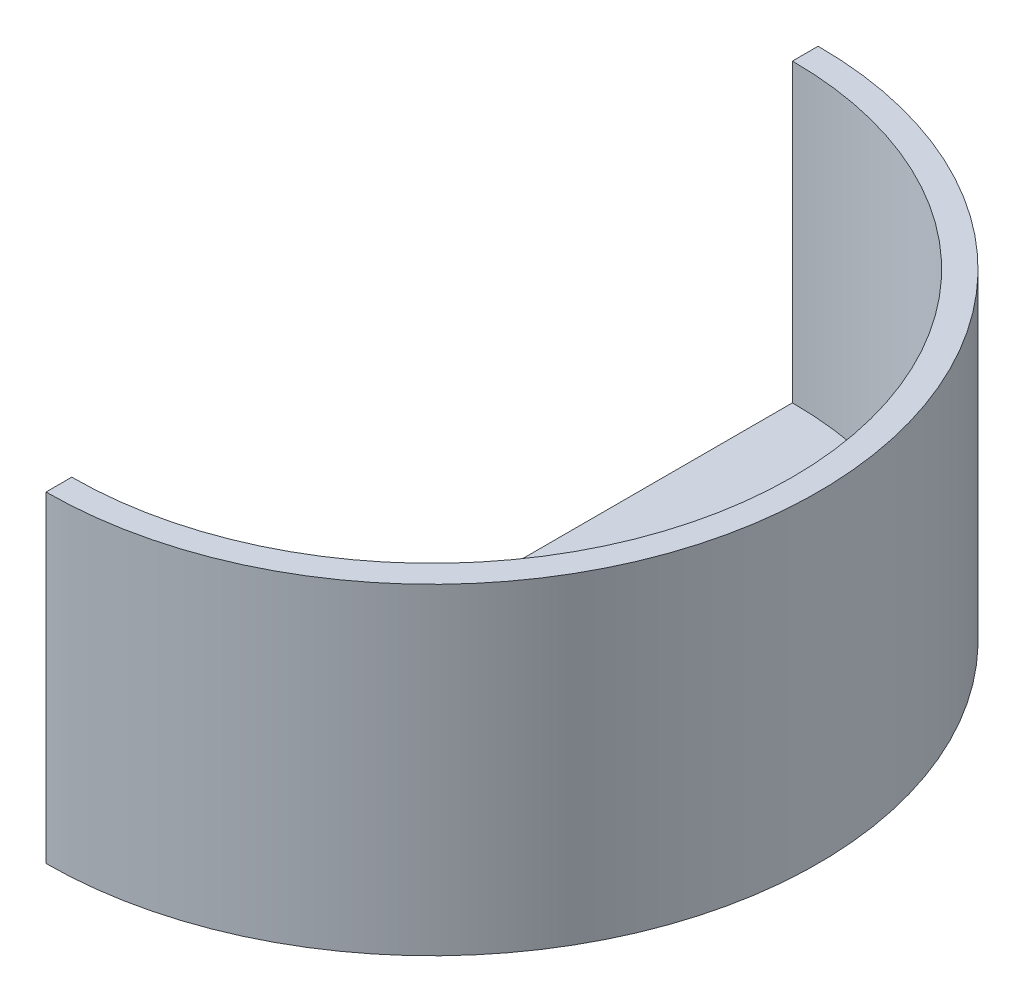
ISO-10303-21;
HEADER;
FILE_DESCRIPTION(('STEP AP214'),'2;1');
FILE_NAME('part.step','',(''),(''),'','','');
FILE_SCHEMA(('AUTOMOTIVE_DESIGN { 1 0 10303 214 1 1 1 1 }'));
ENDSEC;
DATA;
#1=APPLICATION_CONTEXT('core data for automotive mechanical design processes');
#2=APPLICATION_PROTOCOL_DEFINITION('international standard','automotive_design',2000,#1);
#3=PRODUCT_CONTEXT('',#1,'mechanical');
#4=PRODUCT('Part','Part','',(#3));
#5=PRODUCT_RELATED_PRODUCT_CATEGORY('part','',(#4));
#6=PRODUCT_DEFINITION_FORMATION('','',#4);
#7=PRODUCT_DEFINITION_CONTEXT('part definition',#1,'design');
#8=PRODUCT_DEFINITION('design','',#6,#7);
#9=PRODUCT_DEFINITION_SHAPE('','',#8);
#10=(LENGTH_UNIT() NAMED_UNIT(*) SI_UNIT(.MILLI.,.METRE.));
#11=(NAMED_UNIT(*) PLANE_ANGLE_UNIT() SI_UNIT($,.RADIAN.));
#12=(NAMED_UNIT(*) SI_UNIT($,.STERADIAN.) SOLID_ANGLE_UNIT());
#13=UNCERTAINTY_MEASURE_WITH_UNIT(LENGTH_MEASURE(1.E-05),#10,'distance_accuracy_value','');
#14=(GEOMETRIC_REPRESENTATION_CONTEXT(3) GLOBAL_UNCERTAINTY_ASSIGNED_CONTEXT((#13)) GLOBAL_UNIT_ASSIGNED_CONTEXT((#10,
#11,#12)) REPRESENTATION_CONTEXT('',''));
#15=CARTESIAN_POINT('',(0.,0.,0.));
#16=DIRECTION('',(0.,0.,1.));
#17=DIRECTION('',(1.,0.,0.));
#18=AXIS2_PLACEMENT_3D('',#15,#16,#17);
#19=CARTESIAN_POINT('',(15.,25.,0.));
#20=DIRECTION('',(0.,-1.,0.));
#21=DIRECTION('',(0.,0.,-1.));
#22=AXIS2_PLACEMENT_3D('',#19,#20,#21);
#23=CYLINDRICAL_SURFACE('',#22,30.);
#24=CARTESIAN_POINT('',(15.,0.,0.));
#25=DIRECTION('',(0.,1.,0.));
#26=DIRECTION('',(0.,0.,1.));
#27=AXIS2_PLACEMENT_3D('',#24,#25,#26);
#28=CIRCLE('',#27,30.);
#29=CARTESIAN_POINT('',(15.,0.,30.));
#30=VERTEX_POINT('',#29);
#31=CARTESIAN_POINT('',(15.,0.,-30.));
#32=VERTEX_POINT('',#31);
#33=EDGE_CURVE('E77',#30,#32,#28,.T.);
#34=ORIENTED_EDGE('',*,*,#33,.T.);
#35=DIRECTION('',(0.,-1.,0.));
#36=VECTOR('',#35,1.);
#37=CARTESIAN_POINT('',(15.,25.,-30.));
#38=LINE('',#37,#36);
#39=CARTESIAN_POINT('',(15.,25.,-30.));
#40=VERTEX_POINT('',#39);
#41=EDGE_CURVE('E11',#40,#32,#38,.T.);
#42=ORIENTED_EDGE('',*,*,#41,.F.);
#43=CARTESIAN_POINT('',(15.,25.,0.));
#44=DIRECTION('',(0.,1.,0.));
#45=DIRECTION('',(0.,0.,1.));
#46=AXIS2_PLACEMENT_3D('',#43,#44,#45);
#47=CIRCLE('',#46,30.);
#48=CARTESIAN_POINT('',(15.,25.,30.));
#49=VERTEX_POINT('',#48);
#50=EDGE_CURVE('E92',#49,#40,#47,.T.);
#51=ORIENTED_EDGE('',*,*,#50,.F.);
#52=DIRECTION('',(0.,-1.,0.));
#53=VECTOR('',#52,1.);
#54=CARTESIAN_POINT('',(15.,25.,30.));
#55=LINE('',#54,#53);
#56=EDGE_CURVE('E36',#49,#30,#55,.T.);
#57=ORIENTED_EDGE('',*,*,#56,.T.);
#58=EDGE_LOOP('',(#34,#42,#51,#57));
#59=FACE_BOUND('',#58,.T.);
#60=ADVANCED_FACE('F29',(#59),#23,.T.);
#61=CARTESIAN_POINT('',(15.,25.,30.));
#62=DIRECTION('',(1.,0.,0.));
#63=DIRECTION('',(0.,0.,-1.));
#64=AXIS2_PLACEMENT_3D('',#61,#62,#63);
#65=PLANE('',#64);
#66=DIRECTION('',(0.,0.,1.));
#67=VECTOR('',#66,1.);
#68=CARTESIAN_POINT('',(15.,25.,30.));
#69=LINE('',#68,#67);
#70=CARTESIAN_POINT('',(15.,25.,28.));
#71=VERTEX_POINT('',#70);
#72=EDGE_CURVE('E50',#71,#49,#69,.T.);
#73=ORIENTED_EDGE('',*,*,#72,.F.);
#74=DIRECTION('',(0.,-1.,0.));
#75=VECTOR('',#74,1.);
#76=CARTESIAN_POINT('',(15.,25.,28.));
#77=LINE('',#76,#75);
#78=CARTESIAN_POINT('',(15.,2.,28.));
#79=VERTEX_POINT('',#78);
#80=EDGE_CURVE('E43',#71,#79,#77,.T.);
#81=ORIENTED_EDGE('',*,*,#80,.T.);
#82=DIRECTION('',(0.,0.,1.));
#83=VECTOR('',#82,1.);
#84=CARTESIAN_POINT('',(15.,2.,30.));
#85=LINE('',#84,#83);
#86=CARTESIAN_POINT('',(15.,2.,-28.));
#87=VERTEX_POINT('',#86);
#88=EDGE_CURVE('E81',#87,#79,#85,.T.);
#89=ORIENTED_EDGE('',*,*,#88,.F.);
#90=DIRECTION('',(0.,-1.,0.));
#91=VECTOR('',#90,1.);
#92=CARTESIAN_POINT('',(15.,25.,-28.));
#93=LINE('',#92,#91);
#94=CARTESIAN_POINT('',(15.,25.,-28.));
#95=VERTEX_POINT('',#94);
#96=EDGE_CURVE('E69',#95,#87,#93,.T.);
#97=ORIENTED_EDGE('',*,*,#96,.F.);
#98=EDGE_CURVE('E94',#40,#95,#69,.T.);
#99=ORIENTED_EDGE('',*,*,#98,.F.);
#100=ORIENTED_EDGE('',*,*,#41,.T.);
#101=DIRECTION('',(0.,0.,1.));
#102=VECTOR('',#101,1.);
#103=CARTESIAN_POINT('',(15.,0.,30.));
#104=LINE('',#103,#102);
#105=EDGE_CURVE('E90',#32,#30,#104,.T.);
#106=ORIENTED_EDGE('',*,*,#105,.T.);
#107=ORIENTED_EDGE('',*,*,#56,.F.);
#108=EDGE_LOOP('',(#73,#81,#89,#97,#99,#100,#106,#107));
#109=FACE_BOUND('',#108,.T.);
#110=ADVANCED_FACE('F83',(#109),#65,.F.);
#111=CARTESIAN_POINT('',(15.,25.,0.));
#112=DIRECTION('',(0.,1.,0.));
#113=DIRECTION('',(0.,0.,1.));
#114=AXIS2_PLACEMENT_3D('',#111,#112,#113);
#115=PLANE('',#114);
#116=CARTESIAN_POINT('',(15.,25.,0.));
#117=DIRECTION('',(0.,1.,0.));
#118=DIRECTION('',(0.,0.,1.));
#119=AXIS2_PLACEMENT_3D('',#116,#117,#118);
#120=CIRCLE('',#119,28.);
#121=EDGE_CURVE('E73',#71,#95,#120,.T.);
#122=ORIENTED_EDGE('',*,*,#121,.F.);
#123=ORIENTED_EDGE('',*,*,#72,.T.);
#124=ORIENTED_EDGE('',*,*,#50,.T.);
#125=ORIENTED_EDGE('',*,*,#98,.T.);
#126=EDGE_LOOP('',(#122,#123,#124,#125));
#127=FACE_BOUND('',#126,.T.);
#128=ADVANCED_FACE('F102',(#127),#115,.T.);
#129=CARTESIAN_POINT('',(15.,0.,0.));
#130=DIRECTION('',(0.,1.,0.));
#131=DIRECTION('',(0.,0.,1.));
#132=AXIS2_PLACEMENT_3D('',#129,#130,#131);
#133=PLANE('',#132);
#134=ORIENTED_EDGE('',*,*,#33,.F.);
#135=ORIENTED_EDGE('',*,*,#105,.F.);
#136=EDGE_LOOP('',(#134,#135));
#137=FACE_BOUND('',#136,.T.);
#138=ADVANCED_FACE('F101',(#137),#133,.F.);
#139=CARTESIAN_POINT('',(15.,25.,0.));
#140=DIRECTION('',(0.,-1.,0.));
#141=DIRECTION('',(0.,0.,-1.));
#142=AXIS2_PLACEMENT_3D('',#139,#140,#141);
#143=CYLINDRICAL_SURFACE('',#142,28.);
#144=CARTESIAN_POINT('',(15.,2.,0.));
#145=DIRECTION('',(0.,1.,0.));
#146=DIRECTION('',(0.,0.,1.));
#147=AXIS2_PLACEMENT_3D('',#144,#145,#146);
#148=CIRCLE('',#147,28.);
#149=EDGE_CURVE('E72',#79,#87,#148,.T.);
#150=ORIENTED_EDGE('',*,*,#149,.F.);
#151=ORIENTED_EDGE('',*,*,#80,.F.);
#152=ORIENTED_EDGE('',*,*,#121,.T.);
#153=ORIENTED_EDGE('',*,*,#96,.T.);
#154=EDGE_LOOP('',(#150,#151,#152,#153));
#155=FACE_BOUND('',#154,.T.);
#156=ADVANCED_FACE('F71',(#155),#143,.F.);
#157=CARTESIAN_POINT('',(15.,2.,0.));
#158=DIRECTION('',(0.,1.,0.));
#159=DIRECTION('',(0.,0.,1.));
#160=AXIS2_PLACEMENT_3D('',#157,#158,#159);
#161=PLANE('',#160);
#162=ORIENTED_EDGE('',*,*,#149,.T.);
#163=ORIENTED_EDGE('',*,*,#88,.T.);
#164=EDGE_LOOP('',(#162,#163));
#165=FACE_BOUND('',#164,.T.);
#166=ADVANCED_FACE('F80',(#165),#161,.T.);
#167=CLOSED_SHELL('',(#60,#110,#128,#138,#156,#166));
#168=MANIFOLD_SOLID_BREP('B2',#167);
#169=ADVANCED_BREP_SHAPE_REPRESENTATION('',(#18,#168),#14);
#170=SHAPE_DEFINITION_REPRESENTATION(#9,#169);
ENDSEC;
END-ISO-10303-21;
